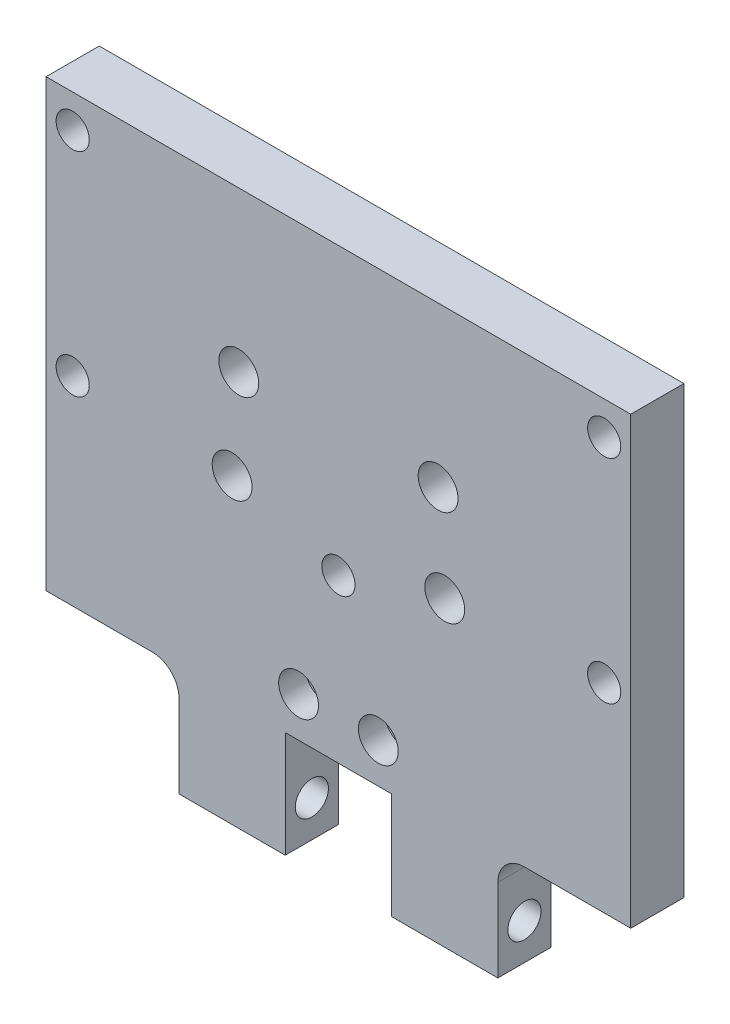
from build123d import *

# Parameters (mm, degrees)
SKETCH2_R           = 4.7625
SKETCH2_R_2         = 3.9624
SKETCH2_R_3         = 3.175
BOSS_EXTRUDE1_DEPTH = 6.35
SKETCH3_R           = 3.9624
CUT_EXTRUDE1_DEPTH  = 101.6
FILLET1_R           = 6.35
SKETCH5_R           = 4.7625
CUT_EXTRUDE3_DEPTH  = 7.62


with BuildPart() as part:
    # Sketch2 → Boss-Extrude1 (new, symmetric)
    with BuildSketch(Plane.XY):
        Polygon((-38.1, -94.4372), (-38.1, -68.2752), (-69.85, -68.2752), (-69.85, 38.1), (69.85, 38.1), (69.85, -68.2752), (38.1, -68.2752), (38.1, -94.4372), (12.7, -94.4372), (12.7, -69.0372), (-12.7, -69.0372), (-12.7, -94.4372), align=None)
        with Locations((-23.8125, 0)):
            Circle(SKETCH2_R, mode=Mode.SUBTRACT)
        with Locations((23.8125, 0)):
            Circle(SKETCH2_R, mode=Mode.SUBTRACT)
        with Locations((-63.5, -20.6248)):
            Circle(SKETCH2_R_2, mode=Mode.SUBTRACT)
        with Locations((-63.5, 30.1752)):
            Circle(SKETCH2_R_2, mode=Mode.SUBTRACT)
        with Locations((63.5, -20.6248)):
            Circle(SKETCH2_R_2, mode=Mode.SUBTRACT)
        with Locations((63.5, 30.1752)):
            Circle(SKETCH2_R_2, mode=Mode.SUBTRACT)
        with Locations((-25.4, -22.225)):
            Circle(SKETCH2_R, mode=Mode.SUBTRACT)
        with Locations((25.4, -22.225)):
            Circle(SKETCH2_R, mode=Mode.SUBTRACT)
        with Locations((0, -30.1752)):
            Circle(SKETCH2_R_2, mode=Mode.SUBTRACT)
        with Locations((-9.525, -59.5122)):
            Circle(SKETCH2_R_3, mode=Mode.SUBTRACT)
        with Locations((9.525, -59.5122)):
            Circle(SKETCH2_R_3, mode=Mode.SUBTRACT)
    extrude(amount=BOSS_EXTRUDE1_DEPTH, both=True)

    # Sketch3 → Cut-Extrude1 (cut, symmetric)
    with BuildSketch(Plane(origin=(0, 0, 0), x_dir=(0, 0, -1), z_dir=(1, 0, 0))):
        with Locations((0, -85.725)):
            Circle(SKETCH3_R)
    extrude(amount=CUT_EXTRUDE1_DEPTH, both=True, mode=Mode.SUBTRACT)

    # Fillet1
    fillet1_edges = [part.edges().sort_by_distance(p)[0] for p in [
        (-38.1, -68.2752, 0),
        (38.1, -68.2752, 0),
    ]]
    fillet(fillet1_edges, radius=FILLET1_R)

    # Sketch5 → Cut-Extrude3 (cut)
    with BuildSketch(Plane.XY):
        with Locations(Location((-9.525, -59.5122, 0), (0, 0, 180))):
            Circle(SKETCH5_R)
        with Locations(Location((9.525, -59.5122, 0), (0, 0, 180))):
            Circle(SKETCH5_R)
    extrude(amount=CUT_EXTRUDE3_DEPTH, mode=Mode.SUBTRACT)


solid = part.part
